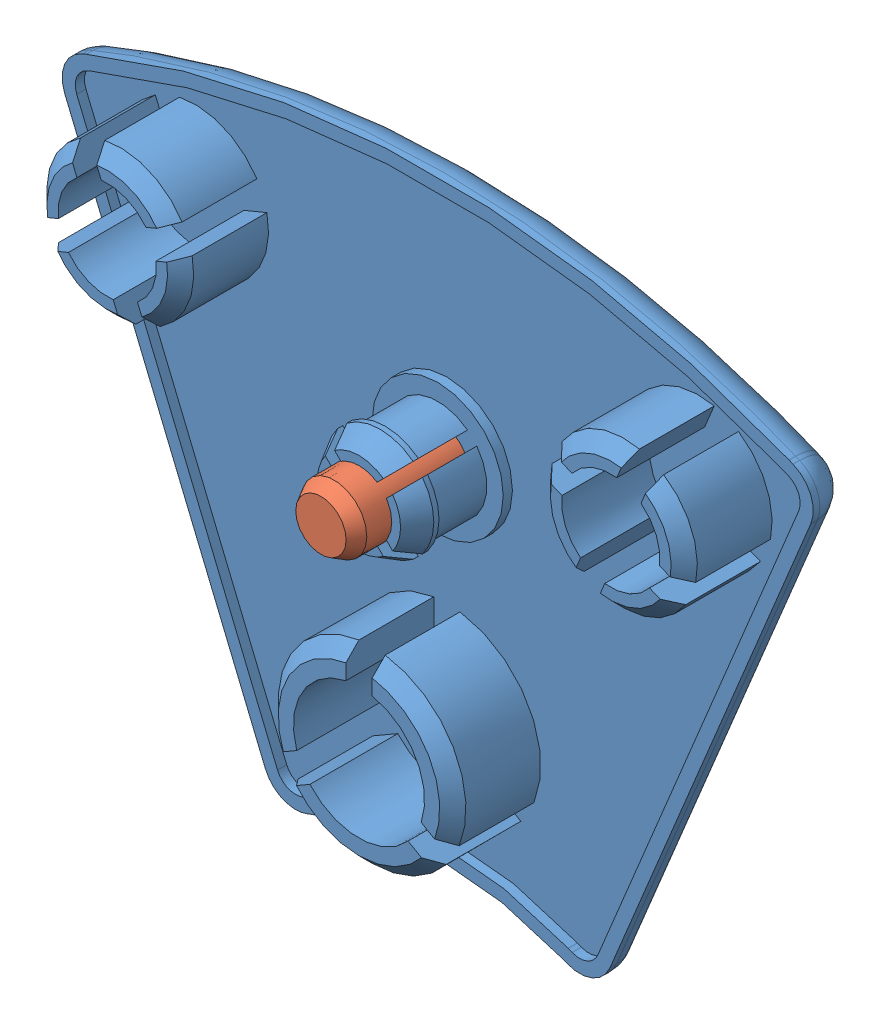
SolidWorks assembly 22.1017_1 END CAP 45 R 45 DEG GRAY.SLDASM, configuration Default (file format 3800). Lengths in mm.
Overall size (57.26 47.22 11.9).
2 component instances, 2 part files, 2 mates.
Components (placement in the parent):
- 22.1017_1  END CAP 45 R 45 DEG GRAY-1: 22.1017_1  END CAP 45 R 45 DEG GRAY.SLDPRT [Default] at origin size (57.26 47.22 9)
- 22_1017_1 END CAP DOWEL-1: 22_1017_1 END CAP DOWEL.SLDPRT [Default] at (-226.2859 -77.9472 13) size (5 5 11.9)
Mates (geometry in assembly coordinates):
- Concentric1: concentric: cylinder of 22.1017_1  END CAP 45 R 45 DEG GRAY-1; cylinder of ?
- Coincident1: coincident aligned: plane of 22.1017_1  END CAP 45 R 45 DEG GRAY-1 through (0 -17.1039 0) normal (0 0 -1); plane of ? through (0 0 67.8996) normal (0 0 -1)
